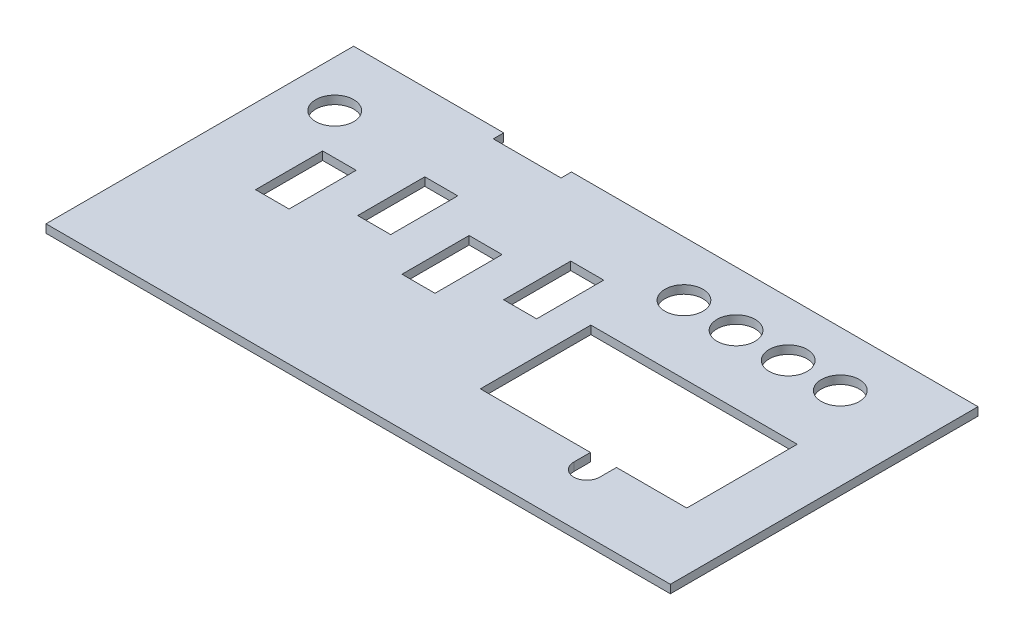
ISO-10303-21;
HEADER;
FILE_DESCRIPTION(('STEP AP214'),'2;1');
FILE_NAME('part.step','',(''),(''),'','','');
FILE_SCHEMA(('AUTOMOTIVE_DESIGN { 1 0 10303 214 1 1 1 1 }'));
ENDSEC;
DATA;
#1=APPLICATION_CONTEXT('core data for automotive mechanical design processes');
#2=APPLICATION_PROTOCOL_DEFINITION('international standard','automotive_design',2000,#1);
#3=PRODUCT_CONTEXT('',#1,'mechanical');
#4=PRODUCT('Part','Part','',(#3));
#5=PRODUCT_RELATED_PRODUCT_CATEGORY('part','',(#4));
#6=PRODUCT_DEFINITION_FORMATION('','',#4);
#7=PRODUCT_DEFINITION_CONTEXT('part definition',#1,'design');
#8=PRODUCT_DEFINITION('design','',#6,#7);
#9=PRODUCT_DEFINITION_SHAPE('','',#8);
#10=(LENGTH_UNIT() NAMED_UNIT(*) SI_UNIT(.MILLI.,.METRE.));
#11=(NAMED_UNIT(*) PLANE_ANGLE_UNIT() SI_UNIT($,.RADIAN.));
#12=(NAMED_UNIT(*) SI_UNIT($,.STERADIAN.) SOLID_ANGLE_UNIT());
#13=UNCERTAINTY_MEASURE_WITH_UNIT(LENGTH_MEASURE(1.E-05),#10,'distance_accuracy_value','');
#14=(GEOMETRIC_REPRESENTATION_CONTEXT(3) GLOBAL_UNCERTAINTY_ASSIGNED_CONTEXT((#13)) GLOBAL_UNIT_ASSIGNED_CONTEXT((#10,
#11,#12)) REPRESENTATION_CONTEXT('',''));
#15=CARTESIAN_POINT('',(0.,0.,0.));
#16=DIRECTION('',(0.,0.,1.));
#17=DIRECTION('',(1.,0.,0.));
#18=AXIS2_PLACEMENT_3D('',#15,#16,#17);
#19=CARTESIAN_POINT('',(48.8,0.,14.76));
#20=DIRECTION('',(0.,0.,1.));
#21=DIRECTION('',(1.,0.,0.));
#22=AXIS2_PLACEMENT_3D('',#19,#20,#21);
#23=PLANE('',#22);
#24=DIRECTION('',(1.,0.,0.));
#25=VECTOR('',#24,1.);
#26=CARTESIAN_POINT('',(48.8,0.,14.76));
#27=LINE('',#26,#25);
#28=CARTESIAN_POINT('',(35.32,0.,14.76));
#29=VERTEX_POINT('',#28);
#30=CARTESIAN_POINT('',(48.8,0.,14.76));
#31=VERTEX_POINT('',#30);
#32=EDGE_CURVE('E449',#29,#31,#27,.T.);
#33=ORIENTED_EDGE('',*,*,#32,.F.);
#34=DIRECTION('',(0.,-1.,0.));
#35=VECTOR('',#34,1.);
#36=CARTESIAN_POINT('',(35.32,1.5875,14.76));
#37=LINE('',#36,#35);
#38=CARTESIAN_POINT('',(35.32,1.5875,14.76));
#39=VERTEX_POINT('',#38);
#40=EDGE_CURVE('E277',#39,#29,#37,.T.);
#41=ORIENTED_EDGE('',*,*,#40,.F.);
#42=DIRECTION('',(1.,0.,0.));
#43=VECTOR('',#42,1.);
#44=CARTESIAN_POINT('',(48.8,1.5875,14.76));
#45=LINE('',#44,#43);
#46=CARTESIAN_POINT('',(48.8,1.5875,14.76));
#47=VERTEX_POINT('',#46);
#48=EDGE_CURVE('E269',#39,#47,#45,.T.);
#49=ORIENTED_EDGE('',*,*,#48,.T.);
#50=DIRECTION('',(0.,1.,0.));
#51=VECTOR('',#50,1.);
#52=CARTESIAN_POINT('',(48.8,0.,14.76));
#53=LINE('',#52,#51);
#54=EDGE_CURVE('E463',#31,#47,#53,.T.);
#55=ORIENTED_EDGE('',*,*,#54,.F.);
#56=EDGE_LOOP('',(#33,#41,#49,#55));
#57=FACE_BOUND('',#56,.T.);
#58=ADVANCED_FACE('F36',(#57),#23,.F.);
#59=CARTESIAN_POINT('',(0.,0.,0.));
#60=DIRECTION('',(0.,-1.,0.));
#61=DIRECTION('',(0.,0.,-1.));
#62=AXIS2_PLACEMENT_3D('',#59,#60,#61);
#63=PLANE('',#62);
#64=DIRECTION('',(0.,0.,1.));
#65=VECTOR('',#64,1.);
#66=CARTESIAN_POINT('',(35.32,0.,17.96));
#67=LINE('',#66,#65);
#68=CARTESIAN_POINT('',(35.32,0.,17.96));
#69=VERTEX_POINT('',#68);
#70=EDGE_CURVE('E251',#29,#69,#67,.T.);
#71=ORIENTED_EDGE('',*,*,#70,.F.);
#72=ORIENTED_EDGE('',*,*,#32,.T.);
#73=DIRECTION('',(0.,0.,-1.));
#74=VECTOR('',#73,1.);
#75=CARTESIAN_POINT('',(48.8,0.,14.76));
#76=LINE('',#75,#74);
#77=CARTESIAN_POINT('',(48.8,0.,-6.43999999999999));
#78=VERTEX_POINT('',#77);
#79=EDGE_CURVE('E439',#31,#78,#76,.T.);
#80=ORIENTED_EDGE('',*,*,#79,.T.);
#81=DIRECTION('',(-1.,0.,0.));
#82=VECTOR('',#81,1.);
#83=CARTESIAN_POINT('',(48.8,0.,-6.43999999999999));
#84=LINE('',#83,#82);
#85=CARTESIAN_POINT('',(9.19999999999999,0.,-6.43999999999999));
#86=VERTEX_POINT('',#85);
#87=EDGE_CURVE('E442',#78,#86,#84,.T.);
#88=ORIENTED_EDGE('',*,*,#87,.T.);
#89=DIRECTION('',(0.,0.,1.));
#90=VECTOR('',#89,1.);
#91=CARTESIAN_POINT('',(9.19999999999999,0.,-6.43999999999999));
#92=LINE('',#91,#90);
#93=CARTESIAN_POINT('',(9.19999999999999,0.,14.76));
#94=VERTEX_POINT('',#93);
#95=EDGE_CURVE('E446',#86,#94,#92,.T.);
#96=ORIENTED_EDGE('',*,*,#95,.T.);
#97=CARTESIAN_POINT('',(30.32,0.,14.76));
#98=VERTEX_POINT('',#97);
#99=EDGE_CURVE('E450',#94,#98,#27,.T.);
#100=ORIENTED_EDGE('',*,*,#99,.T.);
#101=DIRECTION('',(0.,0.,-1.));
#102=VECTOR('',#101,1.);
#103=CARTESIAN_POINT('',(30.32,0.,14.76));
#104=LINE('',#103,#102);
#105=CARTESIAN_POINT('',(30.32,0.,17.96));
#106=VERTEX_POINT('',#105);
#107=EDGE_CURVE('E51',#106,#98,#104,.T.);
#108=ORIENTED_EDGE('',*,*,#107,.F.);
#109=CARTESIAN_POINT('',(32.82,0.,17.96));
#110=DIRECTION('',(0.,-1.,0.));
#111=DIRECTION('',(0.,0.,-1.));
#112=AXIS2_PLACEMENT_3D('',#109,#110,#111);
#113=CIRCLE('',#112,2.5);
#114=EDGE_CURVE('E271',#69,#106,#113,.T.);
#115=ORIENTED_EDGE('',*,*,#114,.F.);
#116=EDGE_LOOP('',(#71,#72,#80,#88,#96,#100,#108,#115));
#117=FACE_BOUND('',#116,.T.);
#118=CARTESIAN_POINT('',(14.,0.,-19.5));
#119=DIRECTION('',(0.,1.,0.));
#120=DIRECTION('',(0.,0.,1.));
#121=AXIS2_PLACEMENT_3D('',#118,#119,#120);
#122=CIRCLE('',#121,3.65000000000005);
#123=CARTESIAN_POINT('',(14.,0.,-15.85));
#124=VERTEX_POINT('',#123);
#125=EDGE_CURVE('E353',#124,#124,#122,.T.);
#126=ORIENTED_EDGE('',*,*,#125,.T.);
#127=EDGE_LOOP('',(#126));
#128=FACE_BOUND('',#127,.T.);
#129=CARTESIAN_POINT('',(34.,0.,-19.5));
#130=DIRECTION('',(0.,1.,0.));
#131=DIRECTION('',(0.,0.,1.));
#132=AXIS2_PLACEMENT_3D('',#129,#130,#131);
#133=CIRCLE('',#132,3.65000000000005);
#134=CARTESIAN_POINT('',(34.,0.,-15.85));
#135=VERTEX_POINT('',#134);
#136=EDGE_CURVE('E360',#135,#135,#133,.T.);
#137=ORIENTED_EDGE('',*,*,#136,.T.);
#138=EDGE_LOOP('',(#137));
#139=FACE_BOUND('',#138,.T.);
#140=CARTESIAN_POINT('',(44.,0.,-19.5));
#141=DIRECTION('',(0.,1.,0.));
#142=DIRECTION('',(0.,0.,1.));
#143=AXIS2_PLACEMENT_3D('',#140,#141,#142);
#144=CIRCLE('',#143,3.65000000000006);
#145=CARTESIAN_POINT('',(44.,0.,-15.8499999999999));
#146=VERTEX_POINT('',#145);
#147=EDGE_CURVE('E366',#146,#146,#144,.T.);
#148=ORIENTED_EDGE('',*,*,#147,.T.);
#149=EDGE_LOOP('',(#148));
#150=FACE_BOUND('',#149,.T.);
#151=CARTESIAN_POINT('',(-51.,0.,-17.5000000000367));
#152=DIRECTION('',(0.,1.,0.));
#153=DIRECTION('',(0.,0.,1.));
#154=AXIS2_PLACEMENT_3D('',#151,#152,#153);
#155=CIRCLE('',#154,3.65000000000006);
#156=CARTESIAN_POINT('',(-51.,0.,-13.8500000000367));
#157=VERTEX_POINT('',#156);
#158=EDGE_CURVE('E372',#157,#157,#155,.T.);
#159=ORIENTED_EDGE('',*,*,#158,.T.);
#160=EDGE_LOOP('',(#159));
#161=FACE_BOUND('',#160,.T.);
#162=DIRECTION('',(-1.,0.,0.));
#163=VECTOR('',#162,1.);
#164=CARTESIAN_POINT('',(2.96550000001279,0.,-15.1431105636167));
#165=LINE('',#164,#163);
#166=CARTESIAN_POINT('',(2.96550000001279,0.,-15.1431105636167));
#167=VERTEX_POINT('',#166);
#168=CARTESIAN_POINT('',(-3.36550000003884,0.,-15.1431105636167));
#169=VERTEX_POINT('',#168);
#170=EDGE_CURVE('E379',#167,#169,#165,.T.);
#171=ORIENTED_EDGE('',*,*,#170,.T.);
#172=DIRECTION('',(2.77146929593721E-12,0.,1.));
#173=VECTOR('',#172,1.);
#174=CARTESIAN_POINT('',(-3.36550000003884,0.,-15.1431105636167));
#175=LINE('',#174,#173);
#176=CARTESIAN_POINT('',(-3.36550000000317,0.,-2.26977374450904));
#177=VERTEX_POINT('',#176);
#178=EDGE_CURVE('E382',#169,#177,#175,.T.);
#179=ORIENTED_EDGE('',*,*,#178,.T.);
#180=DIRECTION('',(1.,0.,0.));
#181=VECTOR('',#180,1.);
#182=CARTESIAN_POINT('',(-3.36550000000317,0.,-2.26977374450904));
#183=LINE('',#182,#181);
#184=CARTESIAN_POINT('',(2.96550000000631,0.,-2.26977374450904));
#185=VERTEX_POINT('',#184);
#186=EDGE_CURVE('E59',#177,#185,#183,.T.);
#187=ORIENTED_EDGE('',*,*,#186,.T.);
#188=DIRECTION('',(5.03303244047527E-13,0.,-1.));
#189=VECTOR('',#188,1.);
#190=CARTESIAN_POINT('',(2.96550000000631,0.,-2.26977374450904));
#191=LINE('',#190,#189);
#192=EDGE_CURVE('E387',#185,#167,#191,.T.);
#193=ORIENTED_EDGE('',*,*,#192,.T.);
#194=EDGE_LOOP('',(#171,#179,#187,#193));
#195=FACE_BOUND('',#194,.T.);
#196=DIRECTION('',(-1.,0.,0.));
#197=VECTOR('',#196,1.);
#198=CARTESIAN_POINT('',(-11.0344999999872,0.,-9.64311056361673));
#199=LINE('',#198,#197);
#200=CARTESIAN_POINT('',(-11.0344999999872,0.,-9.64311056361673));
#201=VERTEX_POINT('',#200);
#202=CARTESIAN_POINT('',(-17.3655000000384,0.,-9.64311056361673));
#203=VERTEX_POINT('',#202);
#204=EDGE_CURVE('E409',#201,#203,#199,.T.);
#205=ORIENTED_EDGE('',*,*,#204,.T.);
#206=DIRECTION('',(3.39578092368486E-12,0.,1.));
#207=VECTOR('',#206,1.);
#208=CARTESIAN_POINT('',(-17.3655000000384,0.,-9.64311056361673));
#209=LINE('',#208,#207);
#210=CARTESIAN_POINT('',(-17.3654999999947,0.,3.23022625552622));
#211=VERTEX_POINT('',#210);
#212=EDGE_CURVE('E412',#203,#211,#209,.T.);
#213=ORIENTED_EDGE('',*,*,#212,.T.);
#214=DIRECTION('',(1.,0.,-5.01524421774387E-12));
#215=VECTOR('',#214,1.);
#216=CARTESIAN_POINT('',(-17.3654999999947,0.,3.23022625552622));
#217=LINE('',#216,#215);
#218=CARTESIAN_POINT('',(-11.0344999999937,0.,3.23022625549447));
#219=VERTEX_POINT('',#218);
#220=EDGE_CURVE('E416',#211,#219,#217,.T.);
#221=ORIENTED_EDGE('',*,*,#220,.T.);
#222=DIRECTION('',(5.03437997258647E-13,0.,-1.));
#223=VECTOR('',#222,1.);
#224=CARTESIAN_POINT('',(-11.0344999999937,0.,3.23022625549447));
#225=LINE('',#224,#223);
#226=EDGE_CURVE('E419',#219,#201,#225,.T.);
#227=ORIENTED_EDGE('',*,*,#226,.T.);
#228=EDGE_LOOP('',(#205,#213,#221,#227));
#229=FACE_BOUND('',#228,.T.);
#230=DIRECTION('',(2.7710650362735E-12,0.,1.));
#231=VECTOR('',#230,1.);
#232=CARTESIAN_POINT('',(-31.3655000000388,0.,-15.1431105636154));
#233=LINE('',#232,#231);
#234=CARTESIAN_POINT('',(-31.3655000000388,0.,-15.1431105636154));
#235=VERTEX_POINT('',#234);
#236=CARTESIAN_POINT('',(-31.3655000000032,0.,-2.26977374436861));
#237=VERTEX_POINT('',#236);
#238=EDGE_CURVE('E283',#235,#237,#233,.T.);
#239=ORIENTED_EDGE('',*,*,#238,.T.);
#240=DIRECTION('',(1.,0.,0.));
#241=VECTOR('',#240,1.);
#242=CARTESIAN_POINT('',(-31.3655000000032,0.,-2.26977374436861));
#243=LINE('',#242,#241);
#244=CARTESIAN_POINT('',(-25.0344999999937,0.,-2.26977374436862));
#245=VERTEX_POINT('',#244);
#246=EDGE_CURVE('E286',#237,#245,#243,.T.);
#247=ORIENTED_EDGE('',*,*,#246,.T.);
#248=DIRECTION('',(5.03168490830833E-13,0.,-1.));
#249=VECTOR('',#248,1.);
#250=CARTESIAN_POINT('',(-25.0344999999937,0.,-2.26977374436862));
#251=LINE('',#250,#249);
#252=CARTESIAN_POINT('',(-25.0344999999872,0.,-15.1431105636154));
#253=VERTEX_POINT('',#252);
#254=EDGE_CURVE('E290',#245,#253,#251,.T.);
#255=ORIENTED_EDGE('',*,*,#254,.T.);
#256=DIRECTION('',(-1.,0.,0.));
#257=VECTOR('',#256,1.);
#258=CARTESIAN_POINT('',(-25.0344999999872,0.,-15.1431105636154));
#259=LINE('',#258,#257);
#260=EDGE_CURVE('E293',#253,#235,#259,.T.);
#261=ORIENTED_EDGE('',*,*,#260,.T.);
#262=EDGE_LOOP('',(#239,#247,#255,#261));
#263=FACE_BOUND('',#262,.T.);
#264=DIRECTION('',(0.,0.,1.));
#265=VECTOR('',#264,1.);
#266=CARTESIAN_POINT('',(-45.46,0.,-9.64311056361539));
#267=LINE('',#266,#265);
#268=CARTESIAN_POINT('',(-45.46,0.,-9.64311056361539));
#269=VERTEX_POINT('',#268);
#270=CARTESIAN_POINT('',(-45.46,0.,3.23022625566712));
#271=VERTEX_POINT('',#270);
#272=EDGE_CURVE('E317',#269,#271,#267,.T.);
#273=ORIENTED_EDGE('',*,*,#272,.T.);
#274=DIRECTION('',(1.,0.,-5.01532301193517E-12));
#275=VECTOR('',#274,1.);
#276=CARTESIAN_POINT('',(-45.46,0.,3.23022625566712));
#277=LINE('',#276,#275);
#278=CARTESIAN_POINT('',(-39.0344999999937,0.,3.2302262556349));
#279=VERTEX_POINT('',#278);
#280=EDGE_CURVE('E320',#271,#279,#277,.T.);
#281=ORIENTED_EDGE('',*,*,#280,.T.);
#282=DIRECTION('',(5.02898984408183E-13,0.,-1.));
#283=VECTOR('',#282,1.);
#284=CARTESIAN_POINT('',(-39.0344999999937,0.,3.2302262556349));
#285=LINE('',#284,#283);
#286=CARTESIAN_POINT('',(-39.0344999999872,0.,-9.64311056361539));
#287=VERTEX_POINT('',#286);
#288=EDGE_CURVE('E324',#279,#287,#285,.T.);
#289=ORIENTED_EDGE('',*,*,#288,.T.);
#290=DIRECTION('',(-1.,0.,0.));
#291=VECTOR('',#290,1.);
#292=CARTESIAN_POINT('',(-39.0344999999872,0.,-9.64311056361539));
#293=LINE('',#292,#291);
#294=EDGE_CURVE('E327',#287,#269,#293,.T.);
#295=ORIENTED_EDGE('',*,*,#294,.T.);
#296=EDGE_LOOP('',(#273,#281,#289,#295));
#297=FACE_BOUND('',#296,.T.);
#298=CARTESIAN_POINT('',(24.,0.,-19.5));
#299=DIRECTION('',(0.,1.,0.));
#300=DIRECTION('',(0.,0.,1.));
#301=AXIS2_PLACEMENT_3D('',#298,#299,#300);
#302=CIRCLE('',#301,3.65000000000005);
#303=CARTESIAN_POINT('',(24.,0.,-15.8499999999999));
#304=VERTEX_POINT('',#303);
#305=EDGE_CURVE('E334',#304,#304,#302,.T.);
#306=ORIENTED_EDGE('',*,*,#305,.T.);
#307=EDGE_LOOP('',(#306));
#308=FACE_BOUND('',#307,.T.);
#309=DIRECTION('',(0.,0.,1.));
#310=VECTOR('',#309,1.);
#311=CARTESIAN_POINT('',(-31.1,0.,-30.02));
#312=LINE('',#311,#310);
#313=CARTESIAN_POINT('',(-31.1,0.,-30.02));
#314=VERTEX_POINT('',#313);
#315=CARTESIAN_POINT('',(-31.1,0.,-28.02));
#316=VERTEX_POINT('',#315);
#317=EDGE_CURVE('E493',#314,#316,#312,.T.);
#318=ORIENTED_EDGE('',*,*,#317,.T.);
#319=DIRECTION('',(1.,0.,0.));
#320=VECTOR('',#319,1.);
#321=CARTESIAN_POINT('',(-31.1,0.,-28.02));
#322=LINE('',#321,#320);
#323=CARTESIAN_POINT('',(-18.1,0.,-28.02));
#324=VERTEX_POINT('',#323);
#325=EDGE_CURVE('E466',#316,#324,#322,.T.);
#326=ORIENTED_EDGE('',*,*,#325,.T.);
#327=DIRECTION('',(0.,0.,-1.));
#328=VECTOR('',#327,1.);
#329=CARTESIAN_POINT('',(-18.1,0.,-28.02));
#330=LINE('',#329,#328);
#331=CARTESIAN_POINT('',(-18.1,0.,-30.02));
#332=VERTEX_POINT('',#331);
#333=EDGE_CURVE('E475',#324,#332,#330,.T.);
#334=ORIENTED_EDGE('',*,*,#333,.T.);
#335=DIRECTION('',(1.,0.,0.));
#336=VECTOR('',#335,1.);
#337=CARTESIAN_POINT('',(-18.1,0.,-30.02));
#338=LINE('',#337,#336);
#339=CARTESIAN_POINT('',(59.895,0.,-30.02));
#340=VERTEX_POINT('',#339);
#341=EDGE_CURVE('E478',#332,#340,#338,.T.);
#342=ORIENTED_EDGE('',*,*,#341,.T.);
#343=DIRECTION('',(0.,0.,1.));
#344=VECTOR('',#343,1.);
#345=CARTESIAN_POINT('',(59.895,0.,-30.02));
#346=LINE('',#345,#344);
#347=CARTESIAN_POINT('',(59.895,0.,29.));
#348=VERTEX_POINT('',#347);
#349=EDGE_CURVE('E481',#340,#348,#346,.T.);
#350=ORIENTED_EDGE('',*,*,#349,.T.);
#351=DIRECTION('',(-1.,0.,0.));
#352=VECTOR('',#351,1.);
#353=CARTESIAN_POINT('',(59.895,0.,29.));
#354=LINE('',#353,#352);
#355=CARTESIAN_POINT('',(-59.895,0.,29.));
#356=VERTEX_POINT('',#355);
#357=EDGE_CURVE('E484',#348,#356,#354,.T.);
#358=ORIENTED_EDGE('',*,*,#357,.T.);
#359=DIRECTION('',(0.,0.,-1.));
#360=VECTOR('',#359,1.);
#361=CARTESIAN_POINT('',(-59.895,0.,29.));
#362=LINE('',#361,#360);
#363=CARTESIAN_POINT('',(-59.895,0.,-30.02));
#364=VERTEX_POINT('',#363);
#365=EDGE_CURVE('E487',#356,#364,#362,.T.);
#366=ORIENTED_EDGE('',*,*,#365,.T.);
#367=DIRECTION('',(1.,0.,0.));
#368=VECTOR('',#367,1.);
#369=CARTESIAN_POINT('',(-59.895,0.,-30.02));
#370=LINE('',#369,#368);
#371=EDGE_CURVE('E490',#364,#314,#370,.T.);
#372=ORIENTED_EDGE('',*,*,#371,.T.);
#373=EDGE_LOOP('',(#318,#326,#334,#342,#350,#358,#366,#372));
#374=FACE_BOUND('',#373,.T.);
#375=ADVANCED_FACE('F38',(#117,#128,#139,#150,#161,#195,#229,#263,#297,#308,#374),#63,.T.);
#376=CARTESIAN_POINT('',(-31.1,10.,-28.02));
#377=DIRECTION('',(0.,0.,-1.));
#378=DIRECTION('',(-1.,0.,0.));
#379=AXIS2_PLACEMENT_3D('',#376,#377,#378);
#380=PLANE('',#379);
#381=DIRECTION('',(1.,0.,0.));
#382=VECTOR('',#381,1.);
#383=CARTESIAN_POINT('',(0.,1.5875,-28.02));
#384=LINE('',#383,#382);
#385=CARTESIAN_POINT('',(-31.1,1.5875,-28.02));
#386=VERTEX_POINT('',#385);
#387=CARTESIAN_POINT('',(-18.1,1.5875,-28.02));
#388=VERTEX_POINT('',#387);
#389=EDGE_CURVE('E12',#386,#388,#384,.T.);
#390=ORIENTED_EDGE('',*,*,#389,.T.);
#391=DIRECTION('',(0.,-1.,0.));
#392=VECTOR('',#391,1.);
#393=CARTESIAN_POINT('',(-18.1,10.,-28.02));
#394=LINE('',#393,#392);
#395=EDGE_CURVE('E496',#388,#324,#394,.T.);
#396=ORIENTED_EDGE('',*,*,#395,.T.);
#397=ORIENTED_EDGE('',*,*,#325,.F.);
#398=DIRECTION('',(0.,-1.,0.));
#399=VECTOR('',#398,1.);
#400=CARTESIAN_POINT('',(-31.1,10.,-28.02));
#401=LINE('',#400,#399);
#402=EDGE_CURVE('E497',#386,#316,#401,.T.);
#403=ORIENTED_EDGE('',*,*,#402,.F.);
#404=EDGE_LOOP('',(#390,#396,#397,#403));
#405=FACE_BOUND('',#404,.T.);
#406=ADVANCED_FACE('F535',(#405),#380,.T.);
#407=CARTESIAN_POINT('',(-31.1,10.,-30.02));
#408=DIRECTION('',(1.,0.,0.));
#409=DIRECTION('',(0.,0.,-1.));
#410=AXIS2_PLACEMENT_3D('',#407,#408,#409);
#411=PLANE('',#410);
#412=DIRECTION('',(0.,0.,1.));
#413=VECTOR('',#412,1.);
#414=CARTESIAN_POINT('',(-31.1,1.5875,0.));
#415=LINE('',#414,#413);
#416=CARTESIAN_POINT('',(-31.1,1.5875,-30.02));
#417=VERTEX_POINT('',#416);
#418=EDGE_CURVE('E44',#417,#386,#415,.T.);
#419=ORIENTED_EDGE('',*,*,#418,.T.);
#420=ORIENTED_EDGE('',*,*,#402,.T.);
#421=ORIENTED_EDGE('',*,*,#317,.F.);
#422=DIRECTION('',(0.,-1.,0.));
#423=VECTOR('',#422,1.);
#424=CARTESIAN_POINT('',(-31.1,10.,-30.02));
#425=LINE('',#424,#423);
#426=EDGE_CURVE('E500',#417,#314,#425,.T.);
#427=ORIENTED_EDGE('',*,*,#426,.F.);
#428=EDGE_LOOP('',(#419,#420,#421,#427));
#429=FACE_BOUND('',#428,.T.);
#430=ADVANCED_FACE('F528',(#429),#411,.T.);
#431=CARTESIAN_POINT('',(-59.895,10.,-30.02));
#432=DIRECTION('',(0.,0.,-1.));
#433=DIRECTION('',(-1.,0.,0.));
#434=AXIS2_PLACEMENT_3D('',#431,#432,#433);
#435=PLANE('',#434);
#436=DIRECTION('',(1.,0.,0.));
#437=VECTOR('',#436,1.);
#438=CARTESIAN_POINT('',(0.,1.5875,-30.02));
#439=LINE('',#438,#437);
#440=CARTESIAN_POINT('',(-59.895,1.5875,-30.02));
#441=VERTEX_POINT('',#440);
#442=EDGE_CURVE('E523',#441,#417,#439,.T.);
#443=ORIENTED_EDGE('',*,*,#442,.T.);
#444=ORIENTED_EDGE('',*,*,#426,.T.);
#445=ORIENTED_EDGE('',*,*,#371,.F.);
#446=DIRECTION('',(0.,-1.,0.));
#447=VECTOR('',#446,1.);
#448=CARTESIAN_POINT('',(-59.895,10.,-30.02));
#449=LINE('',#448,#447);
#450=EDGE_CURVE('E502',#441,#364,#449,.T.);
#451=ORIENTED_EDGE('',*,*,#450,.F.);
#452=EDGE_LOOP('',(#443,#444,#445,#451));
#453=FACE_BOUND('',#452,.T.);
#454=ADVANCED_FACE('F552',(#453),#435,.T.);
#455=CARTESIAN_POINT('',(-59.895,10.,29.));
#456=DIRECTION('',(-1.,0.,0.));
#457=DIRECTION('',(0.,0.,1.));
#458=AXIS2_PLACEMENT_3D('',#455,#456,#457);
#459=PLANE('',#458);
#460=DIRECTION('',(0.,0.,-1.));
#461=VECTOR('',#460,1.);
#462=CARTESIAN_POINT('',(-59.895,1.5875,0.));
#463=LINE('',#462,#461);
#464=CARTESIAN_POINT('',(-59.895,1.5875,29.));
#465=VERTEX_POINT('',#464);
#466=EDGE_CURVE('E521',#465,#441,#463,.T.);
#467=ORIENTED_EDGE('',*,*,#466,.T.);
#468=ORIENTED_EDGE('',*,*,#450,.T.);
#469=ORIENTED_EDGE('',*,*,#365,.F.);
#470=DIRECTION('',(0.,-1.,0.));
#471=VECTOR('',#470,1.);
#472=CARTESIAN_POINT('',(-59.895,10.,29.));
#473=LINE('',#472,#471);
#474=EDGE_CURVE('E504',#465,#356,#473,.T.);
#475=ORIENTED_EDGE('',*,*,#474,.F.);
#476=EDGE_LOOP('',(#467,#468,#469,#475));
#477=FACE_BOUND('',#476,.T.);
#478=ADVANCED_FACE('F557',(#477),#459,.T.);
#479=CARTESIAN_POINT('',(59.895,10.,29.));
#480=DIRECTION('',(0.,0.,1.));
#481=DIRECTION('',(1.,0.,0.));
#482=AXIS2_PLACEMENT_3D('',#479,#480,#481);
#483=PLANE('',#482);
#484=DIRECTION('',(-1.,0.,0.));
#485=VECTOR('',#484,1.);
#486=CARTESIAN_POINT('',(0.,1.5875,29.));
#487=LINE('',#486,#485);
#488=CARTESIAN_POINT('',(59.895,1.5875,29.));
#489=VERTEX_POINT('',#488);
#490=EDGE_CURVE('E519',#489,#465,#487,.T.);
#491=ORIENTED_EDGE('',*,*,#490,.T.);
#492=ORIENTED_EDGE('',*,*,#474,.T.);
#493=ORIENTED_EDGE('',*,*,#357,.F.);
#494=DIRECTION('',(0.,-1.,0.));
#495=VECTOR('',#494,1.);
#496=CARTESIAN_POINT('',(59.895,10.,29.));
#497=LINE('',#496,#495);
#498=EDGE_CURVE('E506',#489,#348,#497,.T.);
#499=ORIENTED_EDGE('',*,*,#498,.F.);
#500=EDGE_LOOP('',(#491,#492,#493,#499));
#501=FACE_BOUND('',#500,.T.);
#502=ADVANCED_FACE('F560',(#501),#483,.T.);
#503=CARTESIAN_POINT('',(59.895,10.,-30.02));
#504=DIRECTION('',(1.,0.,0.));
#505=DIRECTION('',(0.,0.,-1.));
#506=AXIS2_PLACEMENT_3D('',#503,#504,#505);
#507=PLANE('',#506);
#508=DIRECTION('',(0.,0.,1.));
#509=VECTOR('',#508,1.);
#510=CARTESIAN_POINT('',(59.895,1.5875,0.));
#511=LINE('',#510,#509);
#512=CARTESIAN_POINT('',(59.895,1.5875,-30.02));
#513=VERTEX_POINT('',#512);
#514=EDGE_CURVE('E517',#513,#489,#511,.T.);
#515=ORIENTED_EDGE('',*,*,#514,.T.);
#516=ORIENTED_EDGE('',*,*,#498,.T.);
#517=ORIENTED_EDGE('',*,*,#349,.F.);
#518=DIRECTION('',(0.,-1.,0.));
#519=VECTOR('',#518,1.);
#520=CARTESIAN_POINT('',(59.895,10.,-30.02));
#521=LINE('',#520,#519);
#522=EDGE_CURVE('E508',#513,#340,#521,.T.);
#523=ORIENTED_EDGE('',*,*,#522,.F.);
#524=EDGE_LOOP('',(#515,#516,#517,#523));
#525=FACE_BOUND('',#524,.T.);
#526=ADVANCED_FACE('F563',(#525),#507,.T.);
#527=CARTESIAN_POINT('',(-18.1,10.,-30.02));
#528=DIRECTION('',(0.,0.,-1.));
#529=DIRECTION('',(-1.,0.,0.));
#530=AXIS2_PLACEMENT_3D('',#527,#528,#529);
#531=PLANE('',#530);
#532=DIRECTION('',(1.,0.,0.));
#533=VECTOR('',#532,1.);
#534=CARTESIAN_POINT('',(0.,1.5875,-30.02));
#535=LINE('',#534,#533);
#536=CARTESIAN_POINT('',(-18.1,1.5875,-30.02));
#537=VERTEX_POINT('',#536);
#538=EDGE_CURVE('E515',#537,#513,#535,.T.);
#539=ORIENTED_EDGE('',*,*,#538,.T.);
#540=ORIENTED_EDGE('',*,*,#522,.T.);
#541=ORIENTED_EDGE('',*,*,#341,.F.);
#542=DIRECTION('',(0.,-1.,0.));
#543=VECTOR('',#542,1.);
#544=CARTESIAN_POINT('',(-18.1,10.,-30.02));
#545=LINE('',#544,#543);
#546=EDGE_CURVE('E510',#537,#332,#545,.T.);
#547=ORIENTED_EDGE('',*,*,#546,.F.);
#548=EDGE_LOOP('',(#539,#540,#541,#547));
#549=FACE_BOUND('',#548,.T.);
#550=ADVANCED_FACE('F544',(#549),#531,.T.);
#551=CARTESIAN_POINT('',(-18.1,10.,-28.02));
#552=DIRECTION('',(-1.,0.,0.));
#553=DIRECTION('',(0.,0.,1.));
#554=AXIS2_PLACEMENT_3D('',#551,#552,#553);
#555=PLANE('',#554);
#556=DIRECTION('',(0.,0.,-1.));
#557=VECTOR('',#556,1.);
#558=CARTESIAN_POINT('',(-18.1,1.5875,0.));
#559=LINE('',#558,#557);
#560=EDGE_CURVE('E499',#388,#537,#559,.T.);
#561=ORIENTED_EDGE('',*,*,#560,.T.);
#562=ORIENTED_EDGE('',*,*,#546,.T.);
#563=ORIENTED_EDGE('',*,*,#333,.F.);
#564=ORIENTED_EDGE('',*,*,#395,.F.);
#565=EDGE_LOOP('',(#561,#562,#563,#564));
#566=FACE_BOUND('',#565,.T.);
#567=ADVANCED_FACE('F541',(#566),#555,.T.);
#568=CARTESIAN_POINT('',(0.,1.5875,0.));
#569=DIRECTION('',(0.,-1.,0.));
#570=DIRECTION('',(0.,0.,-1.));
#571=AXIS2_PLACEMENT_3D('',#568,#569,#570);
#572=PLANE('',#571);
#573=ORIENTED_EDGE('',*,*,#48,.F.);
#574=DIRECTION('',(0.,0.,1.));
#575=VECTOR('',#574,1.);
#576=CARTESIAN_POINT('',(35.32,1.5875,17.96));
#577=LINE('',#576,#575);
#578=CARTESIAN_POINT('',(35.32,1.5875,17.96));
#579=VERTEX_POINT('',#578);
#580=EDGE_CURVE('E248',#39,#579,#577,.T.);
#581=ORIENTED_EDGE('',*,*,#580,.T.);
#582=CARTESIAN_POINT('',(32.82,1.5875,17.96));
#583=DIRECTION('',(0.,-1.,0.));
#584=DIRECTION('',(0.,0.,-1.));
#585=AXIS2_PLACEMENT_3D('',#582,#583,#584);
#586=CIRCLE('',#585,2.5);
#587=CARTESIAN_POINT('',(30.32,1.5875,17.96));
#588=VERTEX_POINT('',#587);
#589=EDGE_CURVE('E259',#579,#588,#586,.T.);
#590=ORIENTED_EDGE('',*,*,#589,.T.);
#591=DIRECTION('',(0.,0.,-1.));
#592=VECTOR('',#591,1.);
#593=CARTESIAN_POINT('',(30.32,1.5875,14.76));
#594=LINE('',#593,#592);
#595=CARTESIAN_POINT('',(30.32,1.5875,14.76));
#596=VERTEX_POINT('',#595);
#597=EDGE_CURVE('E256',#588,#596,#594,.T.);
#598=ORIENTED_EDGE('',*,*,#597,.T.);
#599=CARTESIAN_POINT('',(9.19999999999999,1.5875,14.76));
#600=VERTEX_POINT('',#599);
#601=EDGE_CURVE('E443',#600,#596,#45,.T.);
#602=ORIENTED_EDGE('',*,*,#601,.F.);
#603=DIRECTION('',(0.,0.,1.));
#604=VECTOR('',#603,1.);
#605=CARTESIAN_POINT('',(9.19999999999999,1.5875,-6.43999999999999));
#606=LINE('',#605,#604);
#607=CARTESIAN_POINT('',(9.19999999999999,1.5875,-6.43999999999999));
#608=VERTEX_POINT('',#607);
#609=EDGE_CURVE('E458',#608,#600,#606,.T.);
#610=ORIENTED_EDGE('',*,*,#609,.F.);
#611=DIRECTION('',(-1.,0.,0.));
#612=VECTOR('',#611,1.);
#613=CARTESIAN_POINT('',(48.8,1.5875,-6.43999999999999));
#614=LINE('',#613,#612);
#615=CARTESIAN_POINT('',(48.8,1.5875,-6.43999999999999));
#616=VERTEX_POINT('',#615);
#617=EDGE_CURVE('E455',#616,#608,#614,.T.);
#618=ORIENTED_EDGE('',*,*,#617,.F.);
#619=DIRECTION('',(0.,0.,-1.));
#620=VECTOR('',#619,1.);
#621=CARTESIAN_POINT('',(48.8,1.5875,14.76));
#622=LINE('',#621,#620);
#623=EDGE_CURVE('E356',#47,#616,#622,.T.);
#624=ORIENTED_EDGE('',*,*,#623,.F.);
#625=EDGE_LOOP('',(#573,#581,#590,#598,#602,#610,#618,#624));
#626=FACE_BOUND('',#625,.T.);
#627=CARTESIAN_POINT('',(14.,1.5875,-19.5));
#628=DIRECTION('',(0.,1.,0.));
#629=DIRECTION('',(0.,0.,1.));
#630=AXIS2_PLACEMENT_3D('',#627,#628,#629);
#631=CIRCLE('',#630,3.65000000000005);
#632=CARTESIAN_POINT('',(14.,1.5875,-15.85));
#633=VERTEX_POINT('',#632);
#634=EDGE_CURVE('E357',#633,#633,#631,.T.);
#635=ORIENTED_EDGE('',*,*,#634,.F.);
#636=EDGE_LOOP('',(#635));
#637=FACE_BOUND('',#636,.T.);
#638=CARTESIAN_POINT('',(34.,1.5875,-19.5));
#639=DIRECTION('',(0.,1.,0.));
#640=DIRECTION('',(0.,0.,1.));
#641=AXIS2_PLACEMENT_3D('',#638,#639,#640);
#642=CIRCLE('',#641,3.65000000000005);
#643=CARTESIAN_POINT('',(34.,1.5875,-15.85));
#644=VERTEX_POINT('',#643);
#645=EDGE_CURVE('E363',#644,#644,#642,.T.);
#646=ORIENTED_EDGE('',*,*,#645,.F.);
#647=EDGE_LOOP('',(#646));
#648=FACE_BOUND('',#647,.T.);
#649=CARTESIAN_POINT('',(44.,1.5875,-19.5));
#650=DIRECTION('',(0.,1.,0.));
#651=DIRECTION('',(0.,0.,1.));
#652=AXIS2_PLACEMENT_3D('',#649,#650,#651);
#653=CIRCLE('',#652,3.65000000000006);
#654=CARTESIAN_POINT('',(44.,1.5875,-15.8499999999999));
#655=VERTEX_POINT('',#654);
#656=EDGE_CURVE('E369',#655,#655,#653,.T.);
#657=ORIENTED_EDGE('',*,*,#656,.F.);
#658=EDGE_LOOP('',(#657));
#659=FACE_BOUND('',#658,.T.);
#660=CARTESIAN_POINT('',(-51.,1.5875,-17.5000000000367));
#661=DIRECTION('',(0.,1.,0.));
#662=DIRECTION('',(0.,0.,1.));
#663=AXIS2_PLACEMENT_3D('',#660,#661,#662);
#664=CIRCLE('',#663,3.65000000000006);
#665=CARTESIAN_POINT('',(-51.,1.5875,-13.8500000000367));
#666=VERTEX_POINT('',#665);
#667=EDGE_CURVE('E375',#666,#666,#664,.T.);
#668=ORIENTED_EDGE('',*,*,#667,.F.);
#669=EDGE_LOOP('',(#668));
#670=FACE_BOUND('',#669,.T.);
#671=DIRECTION('',(2.77146929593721E-12,0.,1.));
#672=VECTOR('',#671,1.);
#673=CARTESIAN_POINT('',(-3.36550000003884,1.5875,-15.1431105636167));
#674=LINE('',#673,#672);
#675=CARTESIAN_POINT('',(-3.36550000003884,1.5875,-15.1431105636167));
#676=VERTEX_POINT('',#675);
#677=CARTESIAN_POINT('',(-3.36550000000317,1.5875,-2.26977374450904));
#678=VERTEX_POINT('',#677);
#679=EDGE_CURVE('E393',#676,#678,#674,.T.);
#680=ORIENTED_EDGE('',*,*,#679,.F.);
#681=DIRECTION('',(-1.,0.,0.));
#682=VECTOR('',#681,1.);
#683=CARTESIAN_POINT('',(2.96550000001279,1.5875,-15.1431105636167));
#684=LINE('',#683,#682);
#685=CARTESIAN_POINT('',(2.96550000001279,1.5875,-15.1431105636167));
#686=VERTEX_POINT('',#685);
#687=EDGE_CURVE('E391',#686,#676,#684,.T.);
#688=ORIENTED_EDGE('',*,*,#687,.F.);
#689=DIRECTION('',(5.03303244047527E-13,0.,-1.));
#690=VECTOR('',#689,1.);
#691=CARTESIAN_POINT('',(2.96550000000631,1.5875,-2.26977374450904));
#692=LINE('',#691,#690);
#693=CARTESIAN_POINT('',(2.96550000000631,1.5875,-2.26977374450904));
#694=VERTEX_POINT('',#693);
#695=EDGE_CURVE('E383',#694,#686,#692,.T.);
#696=ORIENTED_EDGE('',*,*,#695,.F.);
#697=DIRECTION('',(1.,0.,0.));
#698=VECTOR('',#697,1.);
#699=CARTESIAN_POINT('',(-3.36550000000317,1.5875,-2.26977374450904));
#700=LINE('',#699,#698);
#701=EDGE_CURVE('E397',#678,#694,#700,.T.);
#702=ORIENTED_EDGE('',*,*,#701,.F.);
#703=EDGE_LOOP('',(#680,#688,#696,#702));
#704=FACE_BOUND('',#703,.T.);
#705=DIRECTION('',(3.39578092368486E-12,0.,1.));
#706=VECTOR('',#705,1.);
#707=CARTESIAN_POINT('',(-17.3655000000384,1.5875,-9.64311056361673));
#708=LINE('',#707,#706);
#709=CARTESIAN_POINT('',(-17.3655000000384,1.5875,-9.64311056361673));
#710=VERTEX_POINT('',#709);
#711=CARTESIAN_POINT('',(-17.3654999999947,1.5875,3.23022625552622));
#712=VERTEX_POINT('',#711);
#713=EDGE_CURVE('E424',#710,#712,#708,.T.);
#714=ORIENTED_EDGE('',*,*,#713,.F.);
#715=DIRECTION('',(-1.,0.,0.));
#716=VECTOR('',#715,1.);
#717=CARTESIAN_POINT('',(-11.0344999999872,1.5875,-9.64311056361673));
#718=LINE('',#717,#716);
#719=CARTESIAN_POINT('',(-11.0344999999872,1.5875,-9.64311056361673));
#720=VERTEX_POINT('',#719);
#721=EDGE_CURVE('E310',#720,#710,#718,.T.);
#722=ORIENTED_EDGE('',*,*,#721,.F.);
#723=DIRECTION('',(5.03437997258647E-13,0.,-1.));
#724=VECTOR('',#723,1.);
#725=CARTESIAN_POINT('',(-11.0344999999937,1.5875,3.23022625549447));
#726=LINE('',#725,#724);
#727=CARTESIAN_POINT('',(-11.0344999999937,1.5875,3.23022625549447));
#728=VERTEX_POINT('',#727);
#729=EDGE_CURVE('E413',#728,#720,#726,.T.);
#730=ORIENTED_EDGE('',*,*,#729,.F.);
#731=DIRECTION('',(1.,0.,-5.01524421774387E-12));
#732=VECTOR('',#731,1.);
#733=CARTESIAN_POINT('',(-17.3654999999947,1.5875,3.23022625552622));
#734=LINE('',#733,#732);
#735=EDGE_CURVE('E427',#712,#728,#734,.T.);
#736=ORIENTED_EDGE('',*,*,#735,.F.);
#737=EDGE_LOOP('',(#714,#722,#730,#736));
#738=FACE_BOUND('',#737,.T.);
#739=DIRECTION('',(1.,0.,0.));
#740=VECTOR('',#739,1.);
#741=CARTESIAN_POINT('',(-31.3655000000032,1.5875,-2.26977374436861));
#742=LINE('',#741,#740);
#743=CARTESIAN_POINT('',(-31.3655000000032,1.5875,-2.26977374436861));
#744=VERTEX_POINT('',#743);
#745=CARTESIAN_POINT('',(-25.0344999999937,1.5875,-2.26977374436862));
#746=VERTEX_POINT('',#745);
#747=EDGE_CURVE('E299',#744,#746,#742,.T.);
#748=ORIENTED_EDGE('',*,*,#747,.F.);
#749=DIRECTION('',(2.7710650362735E-12,0.,1.));
#750=VECTOR('',#749,1.);
#751=CARTESIAN_POINT('',(-31.3655000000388,1.5875,-15.1431105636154));
#752=LINE('',#751,#750);
#753=CARTESIAN_POINT('',(-31.3655000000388,1.5875,-15.1431105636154));
#754=VERTEX_POINT('',#753);
#755=EDGE_CURVE('E297',#754,#744,#752,.T.);
#756=ORIENTED_EDGE('',*,*,#755,.F.);
#757=DIRECTION('',(-1.,0.,0.));
#758=VECTOR('',#757,1.);
#759=CARTESIAN_POINT('',(-25.0344999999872,1.5875,-15.1431105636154));
#760=LINE('',#759,#758);
#761=CARTESIAN_POINT('',(-25.0344999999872,1.5875,-15.1431105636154));
#762=VERTEX_POINT('',#761);
#763=EDGE_CURVE('E287',#762,#754,#760,.T.);
#764=ORIENTED_EDGE('',*,*,#763,.F.);
#765=DIRECTION('',(5.03168490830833E-13,0.,-1.));
#766=VECTOR('',#765,1.);
#767=CARTESIAN_POINT('',(-25.0344999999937,1.5875,-2.26977374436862));
#768=LINE('',#767,#766);
#769=EDGE_CURVE('E303',#746,#762,#768,.T.);
#770=ORIENTED_EDGE('',*,*,#769,.F.);
#771=EDGE_LOOP('',(#748,#756,#764,#770));
#772=FACE_BOUND('',#771,.T.);
#773=DIRECTION('',(1.,0.,-5.01532301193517E-12));
#774=VECTOR('',#773,1.);
#775=CARTESIAN_POINT('',(-45.46,1.5875,3.23022625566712));
#776=LINE('',#775,#774);
#777=CARTESIAN_POINT('',(-45.46,1.5875,3.23022625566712));
#778=VERTEX_POINT('',#777);
#779=CARTESIAN_POINT('',(-39.0344999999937,1.5875,3.2302262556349));
#780=VERTEX_POINT('',#779);
#781=EDGE_CURVE('E333',#778,#780,#776,.T.);
#782=ORIENTED_EDGE('',*,*,#781,.F.);
#783=DIRECTION('',(0.,0.,1.));
#784=VECTOR('',#783,1.);
#785=CARTESIAN_POINT('',(-45.46,1.5875,-9.64311056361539));
#786=LINE('',#785,#784);
#787=CARTESIAN_POINT('',(-45.46,1.5875,-9.64311056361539));
#788=VERTEX_POINT('',#787);
#789=EDGE_CURVE('E331',#788,#778,#786,.T.);
#790=ORIENTED_EDGE('',*,*,#789,.F.);
#791=DIRECTION('',(-1.,0.,0.));
#792=VECTOR('',#791,1.);
#793=CARTESIAN_POINT('',(-39.0344999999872,1.5875,-9.64311056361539));
#794=LINE('',#793,#792);
#795=CARTESIAN_POINT('',(-39.0344999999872,1.5875,-9.64311056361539));
#796=VERTEX_POINT('',#795);
#797=EDGE_CURVE('E321',#796,#788,#794,.T.);
#798=ORIENTED_EDGE('',*,*,#797,.F.);
#799=DIRECTION('',(5.02898984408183E-13,0.,-1.));
#800=VECTOR('',#799,1.);
#801=CARTESIAN_POINT('',(-39.0344999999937,1.5875,3.2302262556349));
#802=LINE('',#801,#800);
#803=EDGE_CURVE('E337',#780,#796,#802,.T.);
#804=ORIENTED_EDGE('',*,*,#803,.F.);
#805=EDGE_LOOP('',(#782,#790,#798,#804));
#806=FACE_BOUND('',#805,.T.);
#807=CARTESIAN_POINT('',(24.,1.5875,-19.5));
#808=DIRECTION('',(0.,1.,0.));
#809=DIRECTION('',(0.,0.,1.));
#810=AXIS2_PLACEMENT_3D('',#807,#808,#809);
#811=CIRCLE('',#810,3.65000000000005);
#812=CARTESIAN_POINT('',(24.,1.5875,-15.8499999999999));
#813=VERTEX_POINT('',#812);
#814=EDGE_CURVE('E279',#813,#813,#811,.T.);
#815=ORIENTED_EDGE('',*,*,#814,.F.);
#816=EDGE_LOOP('',(#815));
#817=FACE_BOUND('',#816,.T.);
#818=ORIENTED_EDGE('',*,*,#389,.F.);
#819=ORIENTED_EDGE('',*,*,#418,.F.);
#820=ORIENTED_EDGE('',*,*,#442,.F.);
#821=ORIENTED_EDGE('',*,*,#466,.F.);
#822=ORIENTED_EDGE('',*,*,#490,.F.);
#823=ORIENTED_EDGE('',*,*,#514,.F.);
#824=ORIENTED_EDGE('',*,*,#538,.F.);
#825=ORIENTED_EDGE('',*,*,#560,.F.);
#826=EDGE_LOOP('',(#818,#819,#820,#821,#822,#823,#824,#825));
#827=FACE_BOUND('',#826,.T.);
#828=ADVANCED_FACE('F266',(#626,#637,#648,#659,#670,#704,#738,#772,#806,#817,#827),#572,.F.);
#829=CARTESIAN_POINT('',(48.8,0.,14.76));
#830=DIRECTION('',(1.,0.,0.));
#831=DIRECTION('',(0.,0.,-1.));
#832=AXIS2_PLACEMENT_3D('',#829,#830,#831);
#833=PLANE('',#832);
#834=ORIENTED_EDGE('',*,*,#623,.T.);
#835=DIRECTION('',(0.,1.,0.));
#836=VECTOR('',#835,1.);
#837=CARTESIAN_POINT('',(48.8,0.,-6.43999999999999));
#838=LINE('',#837,#836);
#839=EDGE_CURVE('E453',#78,#616,#838,.T.);
#840=ORIENTED_EDGE('',*,*,#839,.F.);
#841=ORIENTED_EDGE('',*,*,#79,.F.);
#842=ORIENTED_EDGE('',*,*,#54,.T.);
#843=EDGE_LOOP('',(#834,#840,#841,#842));
#844=FACE_BOUND('',#843,.T.);
#845=ADVANCED_FACE('F587',(#844),#833,.F.);
#846=ORIENTED_EDGE('',*,*,#601,.T.);
#847=DIRECTION('',(0.,-1.,0.));
#848=VECTOR('',#847,1.);
#849=CARTESIAN_POINT('',(30.32,1.5875,14.76));
#850=LINE('',#849,#848);
#851=EDGE_CURVE('E280',#596,#98,#850,.T.);
#852=ORIENTED_EDGE('',*,*,#851,.T.);
#853=ORIENTED_EDGE('',*,*,#99,.F.);
#854=DIRECTION('',(0.,1.,0.));
#855=VECTOR('',#854,1.);
#856=CARTESIAN_POINT('',(9.19999999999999,0.,14.76));
#857=LINE('',#856,#855);
#858=EDGE_CURVE('E467',#94,#600,#857,.T.);
#859=ORIENTED_EDGE('',*,*,#858,.T.);
#860=EDGE_LOOP('',(#846,#852,#853,#859));
#861=FACE_BOUND('',#860,.T.);
#862=ADVANCED_FACE('F575',(#861),#23,.F.);
#863=CARTESIAN_POINT('',(9.19999999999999,0.,-6.43999999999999));
#864=DIRECTION('',(-1.,0.,0.));
#865=DIRECTION('',(0.,0.,1.));
#866=AXIS2_PLACEMENT_3D('',#863,#864,#865);
#867=PLANE('',#866);
#868=ORIENTED_EDGE('',*,*,#609,.T.);
#869=ORIENTED_EDGE('',*,*,#858,.F.);
#870=ORIENTED_EDGE('',*,*,#95,.F.);
#871=DIRECTION('',(0.,1.,0.));
#872=VECTOR('',#871,1.);
#873=CARTESIAN_POINT('',(9.19999999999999,0.,-6.43999999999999));
#874=LINE('',#873,#872);
#875=EDGE_CURVE('E469',#86,#608,#874,.T.);
#876=ORIENTED_EDGE('',*,*,#875,.T.);
#877=EDGE_LOOP('',(#868,#869,#870,#876));
#878=FACE_BOUND('',#877,.T.);
#879=ADVANCED_FACE('F586',(#878),#867,.F.);
#880=CARTESIAN_POINT('',(48.8,0.,-6.43999999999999));
#881=DIRECTION('',(0.,0.,-1.));
#882=DIRECTION('',(-1.,0.,0.));
#883=AXIS2_PLACEMENT_3D('',#880,#881,#882);
#884=PLANE('',#883);
#885=ORIENTED_EDGE('',*,*,#617,.T.);
#886=ORIENTED_EDGE('',*,*,#875,.F.);
#887=ORIENTED_EDGE('',*,*,#87,.F.);
#888=ORIENTED_EDGE('',*,*,#839,.T.);
#889=EDGE_LOOP('',(#885,#886,#887,#888));
#890=FACE_BOUND('',#889,.T.);
#891=ADVANCED_FACE('F593',(#890),#884,.F.);
#892=CARTESIAN_POINT('',(24.,0.,-19.5));
#893=DIRECTION('',(0.,1.,0.));
#894=DIRECTION('',(0.,0.,1.));
#895=AXIS2_PLACEMENT_3D('',#892,#893,#894);
#896=CYLINDRICAL_SURFACE('',#895,3.65000000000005);
#897=ORIENTED_EDGE('',*,*,#305,.F.);
#898=EDGE_LOOP('',(#897));
#899=FACE_BOUND('',#898,.T.);
#900=ORIENTED_EDGE('',*,*,#814,.T.);
#901=EDGE_LOOP('',(#900));
#902=FACE_BOUND('',#901,.T.);
#903=ADVANCED_FACE('F609',(#899,#902),#896,.F.);
#904=CARTESIAN_POINT('',(-45.46,0.,-9.64311056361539));
#905=DIRECTION('',(-1.,0.,0.));
#906=DIRECTION('',(0.,0.,1.));
#907=AXIS2_PLACEMENT_3D('',#904,#905,#906);
#908=PLANE('',#907);
#909=ORIENTED_EDGE('',*,*,#789,.T.);
#910=DIRECTION('',(0.,1.,0.));
#911=VECTOR('',#910,1.);
#912=CARTESIAN_POINT('',(-45.46,0.,3.23022625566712));
#913=LINE('',#912,#911);
#914=EDGE_CURVE('E330',#271,#778,#913,.T.);
#915=ORIENTED_EDGE('',*,*,#914,.F.);
#916=ORIENTED_EDGE('',*,*,#272,.F.);
#917=DIRECTION('',(0.,1.,0.));
#918=VECTOR('',#917,1.);
#919=CARTESIAN_POINT('',(-45.46,0.,-9.64311056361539));
#920=LINE('',#919,#918);
#921=EDGE_CURVE('E300',#269,#788,#920,.T.);
#922=ORIENTED_EDGE('',*,*,#921,.T.);
#923=EDGE_LOOP('',(#909,#915,#916,#922));
#924=FACE_BOUND('',#923,.T.);
#925=ADVANCED_FACE('F614',(#924),#908,.F.);
#926=CARTESIAN_POINT('',(-39.0344999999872,0.,-9.64311056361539));
#927=DIRECTION('',(0.,0.,-1.));
#928=DIRECTION('',(-1.,0.,0.));
#929=AXIS2_PLACEMENT_3D('',#926,#927,#928);
#930=PLANE('',#929);
#931=ORIENTED_EDGE('',*,*,#797,.T.);
#932=ORIENTED_EDGE('',*,*,#921,.F.);
#933=ORIENTED_EDGE('',*,*,#294,.F.);
#934=DIRECTION('',(0.,1.,0.));
#935=VECTOR('',#934,1.);
#936=CARTESIAN_POINT('',(-39.0344999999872,0.,-9.64311056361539));
#937=LINE('',#936,#935);
#938=EDGE_CURVE('E343',#287,#796,#937,.T.);
#939=ORIENTED_EDGE('',*,*,#938,.T.);
#940=EDGE_LOOP('',(#931,#932,#933,#939));
#941=FACE_BOUND('',#940,.T.);
#942=ADVANCED_FACE('F681',(#941),#930,.F.);
#943=CARTESIAN_POINT('',(-39.0344999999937,0.,3.2302262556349));
#944=DIRECTION('',(1.,0.,5.02898984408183E-13));
#945=DIRECTION('',(5.02898984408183E-13,0.,-1.));
#946=AXIS2_PLACEMENT_3D('',#943,#944,#945);
#947=PLANE('',#946);
#948=ORIENTED_EDGE('',*,*,#803,.T.);
#949=ORIENTED_EDGE('',*,*,#938,.F.);
#950=ORIENTED_EDGE('',*,*,#288,.F.);
#951=DIRECTION('',(0.,1.,0.));
#952=VECTOR('',#951,1.);
#953=CARTESIAN_POINT('',(-39.0344999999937,0.,3.2302262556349));
#954=LINE('',#953,#952);
#955=EDGE_CURVE('E345',#279,#780,#954,.T.);
#956=ORIENTED_EDGE('',*,*,#955,.T.);
#957=EDGE_LOOP('',(#948,#949,#950,#956));
#958=FACE_BOUND('',#957,.T.);
#959=ADVANCED_FACE('F691',(#958),#947,.F.);
#960=CARTESIAN_POINT('',(-45.46,0.,3.23022625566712));
#961=DIRECTION('',(5.01532301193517E-12,0.,1.));
#962=DIRECTION('',(1.,0.,-5.01532301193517E-12));
#963=AXIS2_PLACEMENT_3D('',#960,#961,#962);
#964=PLANE('',#963);
#965=ORIENTED_EDGE('',*,*,#781,.T.);
#966=ORIENTED_EDGE('',*,*,#955,.F.);
#967=ORIENTED_EDGE('',*,*,#280,.F.);
#968=ORIENTED_EDGE('',*,*,#914,.T.);
#969=EDGE_LOOP('',(#965,#966,#967,#968));
#970=FACE_BOUND('',#969,.T.);
#971=ADVANCED_FACE('F701',(#970),#964,.F.);
#972=CARTESIAN_POINT('',(-31.3655000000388,0.,-15.1431105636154));
#973=DIRECTION('',(-1.,0.,2.7710650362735E-12));
#974=DIRECTION('',(2.7710650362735E-12,0.,1.));
#975=AXIS2_PLACEMENT_3D('',#972,#973,#974);
#976=PLANE('',#975);
#977=ORIENTED_EDGE('',*,*,#755,.T.);
#978=DIRECTION('',(0.,1.,0.));
#979=VECTOR('',#978,1.);
#980=CARTESIAN_POINT('',(-31.3655000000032,0.,-2.26977374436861));
#981=LINE('',#980,#979);
#982=EDGE_CURVE('E296',#237,#744,#981,.T.);
#983=ORIENTED_EDGE('',*,*,#982,.F.);
#984=ORIENTED_EDGE('',*,*,#238,.F.);
#985=DIRECTION('',(0.,1.,0.));
#986=VECTOR('',#985,1.);
#987=CARTESIAN_POINT('',(-31.3655000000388,0.,-15.1431105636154));
#988=LINE('',#987,#986);
#989=EDGE_CURVE('E308',#235,#754,#988,.T.);
#990=ORIENTED_EDGE('',*,*,#989,.T.);
#991=EDGE_LOOP('',(#977,#983,#984,#990));
#992=FACE_BOUND('',#991,.T.);
#993=ADVANCED_FACE('F711',(#992),#976,.F.);
#994=CARTESIAN_POINT('',(-25.0344999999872,0.,-15.1431105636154));
#995=DIRECTION('',(0.,0.,-1.));
#996=DIRECTION('',(-1.,0.,0.));
#997=AXIS2_PLACEMENT_3D('',#994,#995,#996);
#998=PLANE('',#997);
#999=ORIENTED_EDGE('',*,*,#763,.T.);
#1000=ORIENTED_EDGE('',*,*,#989,.F.);
#1001=ORIENTED_EDGE('',*,*,#260,.F.);
#1002=DIRECTION('',(0.,1.,0.));
#1003=VECTOR('',#1002,1.);
#1004=CARTESIAN_POINT('',(-25.0344999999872,0.,-15.1431105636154));
#1005=LINE('',#1004,#1003);
#1006=EDGE_CURVE('E311',#253,#762,#1005,.T.);
#1007=ORIENTED_EDGE('',*,*,#1006,.T.);
#1008=EDGE_LOOP('',(#999,#1000,#1001,#1007));
#1009=FACE_BOUND('',#1008,.T.);
#1010=ADVANCED_FACE('F721',(#1009),#998,.F.);
#1011=CARTESIAN_POINT('',(-25.0344999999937,0.,-2.26977374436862));
#1012=DIRECTION('',(1.,0.,5.03168490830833E-13));
#1013=DIRECTION('',(5.03168490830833E-13,0.,-1.));
#1014=AXIS2_PLACEMENT_3D('',#1011,#1012,#1013);
#1015=PLANE('',#1014);
#1016=ORIENTED_EDGE('',*,*,#769,.T.);
#1017=ORIENTED_EDGE('',*,*,#1006,.F.);
#1018=ORIENTED_EDGE('',*,*,#254,.F.);
#1019=DIRECTION('',(0.,1.,0.));
#1020=VECTOR('',#1019,1.);
#1021=CARTESIAN_POINT('',(-25.0344999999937,0.,-2.26977374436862));
#1022=LINE('',#1021,#1020);
#1023=EDGE_CURVE('E313',#245,#746,#1022,.T.);
#1024=ORIENTED_EDGE('',*,*,#1023,.T.);
#1025=EDGE_LOOP('',(#1016,#1017,#1018,#1024));
#1026=FACE_BOUND('',#1025,.T.);
#1027=ADVANCED_FACE('F731',(#1026),#1015,.F.);
#1028=CARTESIAN_POINT('',(-31.3655000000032,0.,-2.26977374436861));
#1029=DIRECTION('',(0.,0.,1.));
#1030=DIRECTION('',(1.,0.,0.));
#1031=AXIS2_PLACEMENT_3D('',#1028,#1029,#1030);
#1032=PLANE('',#1031);
#1033=ORIENTED_EDGE('',*,*,#747,.T.);
#1034=ORIENTED_EDGE('',*,*,#1023,.F.);
#1035=ORIENTED_EDGE('',*,*,#246,.F.);
#1036=ORIENTED_EDGE('',*,*,#982,.T.);
#1037=EDGE_LOOP('',(#1033,#1034,#1035,#1036));
#1038=FACE_BOUND('',#1037,.T.);
#1039=ADVANCED_FACE('F741',(#1038),#1032,.F.);
#1040=CARTESIAN_POINT('',(-11.0344999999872,0.,-9.64311056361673));
#1041=DIRECTION('',(0.,0.,-1.));
#1042=DIRECTION('',(-1.,0.,0.));
#1043=AXIS2_PLACEMENT_3D('',#1040,#1041,#1042);
#1044=PLANE('',#1043);
#1045=ORIENTED_EDGE('',*,*,#721,.T.);
#1046=DIRECTION('',(0.,1.,0.));
#1047=VECTOR('',#1046,1.);
#1048=CARTESIAN_POINT('',(-17.3655000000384,0.,-9.64311056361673));
#1049=LINE('',#1048,#1047);
#1050=EDGE_CURVE('E422',#203,#710,#1049,.T.);
#1051=ORIENTED_EDGE('',*,*,#1050,.F.);
#1052=ORIENTED_EDGE('',*,*,#204,.F.);
#1053=DIRECTION('',(0.,1.,0.));
#1054=VECTOR('',#1053,1.);
#1055=CARTESIAN_POINT('',(-11.0344999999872,0.,-9.64311056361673));
#1056=LINE('',#1055,#1054);
#1057=EDGE_CURVE('E394',#201,#720,#1056,.T.);
#1058=ORIENTED_EDGE('',*,*,#1057,.T.);
#1059=EDGE_LOOP('',(#1045,#1051,#1052,#1058));
#1060=FACE_BOUND('',#1059,.T.);
#1061=ADVANCED_FACE('F751',(#1060),#1044,.F.);
#1062=CARTESIAN_POINT('',(-11.0344999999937,0.,3.23022625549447));
#1063=DIRECTION('',(1.,0.,5.03437997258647E-13));
#1064=DIRECTION('',(5.03437997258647E-13,0.,-1.));
#1065=AXIS2_PLACEMENT_3D('',#1062,#1063,#1064);
#1066=PLANE('',#1065);
#1067=ORIENTED_EDGE('',*,*,#729,.T.);
#1068=ORIENTED_EDGE('',*,*,#1057,.F.);
#1069=ORIENTED_EDGE('',*,*,#226,.F.);
#1070=DIRECTION('',(0.,1.,0.));
#1071=VECTOR('',#1070,1.);
#1072=CARTESIAN_POINT('',(-11.0344999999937,0.,3.23022625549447));
#1073=LINE('',#1072,#1071);
#1074=EDGE_CURVE('E433',#219,#728,#1073,.T.);
#1075=ORIENTED_EDGE('',*,*,#1074,.T.);
#1076=EDGE_LOOP('',(#1067,#1068,#1069,#1075));
#1077=FACE_BOUND('',#1076,.T.);
#1078=ADVANCED_FACE('F761',(#1077),#1066,.F.);
#1079=CARTESIAN_POINT('',(-17.3654999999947,0.,3.23022625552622));
#1080=DIRECTION('',(5.01524421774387E-12,0.,1.));
#1081=DIRECTION('',(1.,0.,-5.01524421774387E-12));
#1082=AXIS2_PLACEMENT_3D('',#1079,#1080,#1081);
#1083=PLANE('',#1082);
#1084=ORIENTED_EDGE('',*,*,#735,.T.);
#1085=ORIENTED_EDGE('',*,*,#1074,.F.);
#1086=ORIENTED_EDGE('',*,*,#220,.F.);
#1087=DIRECTION('',(0.,1.,0.));
#1088=VECTOR('',#1087,1.);
#1089=CARTESIAN_POINT('',(-17.3654999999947,0.,3.23022625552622));
#1090=LINE('',#1089,#1088);
#1091=EDGE_CURVE('E435',#211,#712,#1090,.T.);
#1092=ORIENTED_EDGE('',*,*,#1091,.T.);
#1093=EDGE_LOOP('',(#1084,#1085,#1086,#1092));
#1094=FACE_BOUND('',#1093,.T.);
#1095=ADVANCED_FACE('F770',(#1094),#1083,.F.);
#1096=CARTESIAN_POINT('',(-17.3655000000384,0.,-9.64311056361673));
#1097=DIRECTION('',(-1.,0.,3.39578092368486E-12));
#1098=DIRECTION('',(3.39578092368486E-12,0.,1.));
#1099=AXIS2_PLACEMENT_3D('',#1096,#1097,#1098);
#1100=PLANE('',#1099);
#1101=ORIENTED_EDGE('',*,*,#713,.T.);
#1102=ORIENTED_EDGE('',*,*,#1091,.F.);
#1103=ORIENTED_EDGE('',*,*,#212,.F.);
#1104=ORIENTED_EDGE('',*,*,#1050,.T.);
#1105=EDGE_LOOP('',(#1101,#1102,#1103,#1104));
#1106=FACE_BOUND('',#1105,.T.);
#1107=ADVANCED_FACE('F780',(#1106),#1100,.F.);
#1108=CARTESIAN_POINT('',(2.96550000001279,0.,-15.1431105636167));
#1109=DIRECTION('',(0.,0.,-1.));
#1110=DIRECTION('',(-1.,0.,0.));
#1111=AXIS2_PLACEMENT_3D('',#1108,#1109,#1110);
#1112=PLANE('',#1111);
#1113=ORIENTED_EDGE('',*,*,#687,.T.);
#1114=DIRECTION('',(0.,1.,0.));
#1115=VECTOR('',#1114,1.);
#1116=CARTESIAN_POINT('',(-3.36550000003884,0.,-15.1431105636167));
#1117=LINE('',#1116,#1115);
#1118=EDGE_CURVE('E390',#169,#676,#1117,.T.);
#1119=ORIENTED_EDGE('',*,*,#1118,.F.);
#1120=ORIENTED_EDGE('',*,*,#170,.F.);
#1121=DIRECTION('',(0.,1.,0.));
#1122=VECTOR('',#1121,1.);
#1123=CARTESIAN_POINT('',(2.96550000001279,0.,-15.1431105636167));
#1124=LINE('',#1123,#1122);
#1125=EDGE_CURVE('E378',#167,#686,#1124,.T.);
#1126=ORIENTED_EDGE('',*,*,#1125,.T.);
#1127=EDGE_LOOP('',(#1113,#1119,#1120,#1126));
#1128=FACE_BOUND('',#1127,.T.);
#1129=ADVANCED_FACE('F790',(#1128),#1112,.F.);
#1130=CARTESIAN_POINT('',(2.96550000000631,0.,-2.26977374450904));
#1131=DIRECTION('',(1.,0.,5.03303244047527E-13));
#1132=DIRECTION('',(5.03303244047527E-13,0.,-1.));
#1133=AXIS2_PLACEMENT_3D('',#1130,#1131,#1132);
#1134=PLANE('',#1133);
#1135=ORIENTED_EDGE('',*,*,#695,.T.);
#1136=ORIENTED_EDGE('',*,*,#1125,.F.);
#1137=ORIENTED_EDGE('',*,*,#192,.F.);
#1138=DIRECTION('',(0.,1.,0.));
#1139=VECTOR('',#1138,1.);
#1140=CARTESIAN_POINT('',(2.96550000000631,0.,-2.26977374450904));
#1141=LINE('',#1140,#1139);
#1142=EDGE_CURVE('E403',#185,#694,#1141,.T.);
#1143=ORIENTED_EDGE('',*,*,#1142,.T.);
#1144=EDGE_LOOP('',(#1135,#1136,#1137,#1143));
#1145=FACE_BOUND('',#1144,.T.);
#1146=ADVANCED_FACE('F800',(#1145),#1134,.F.);
#1147=CARTESIAN_POINT('',(-3.36550000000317,0.,-2.26977374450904));
#1148=DIRECTION('',(0.,0.,1.));
#1149=DIRECTION('',(1.,0.,0.));
#1150=AXIS2_PLACEMENT_3D('',#1147,#1148,#1149);
#1151=PLANE('',#1150);
#1152=ORIENTED_EDGE('',*,*,#701,.T.);
#1153=ORIENTED_EDGE('',*,*,#1142,.F.);
#1154=ORIENTED_EDGE('',*,*,#186,.F.);
#1155=DIRECTION('',(0.,1.,0.));
#1156=VECTOR('',#1155,1.);
#1157=CARTESIAN_POINT('',(-3.36550000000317,0.,-2.26977374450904));
#1158=LINE('',#1157,#1156);
#1159=EDGE_CURVE('E405',#177,#678,#1158,.T.);
#1160=ORIENTED_EDGE('',*,*,#1159,.T.);
#1161=EDGE_LOOP('',(#1152,#1153,#1154,#1160));
#1162=FACE_BOUND('',#1161,.T.);
#1163=ADVANCED_FACE('F810',(#1162),#1151,.F.);
#1164=CARTESIAN_POINT('',(-3.36550000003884,0.,-15.1431105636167));
#1165=DIRECTION('',(-1.,0.,2.77146929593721E-12));
#1166=DIRECTION('',(2.77146929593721E-12,0.,1.));
#1167=AXIS2_PLACEMENT_3D('',#1164,#1165,#1166);
#1168=PLANE('',#1167);
#1169=ORIENTED_EDGE('',*,*,#679,.T.);
#1170=ORIENTED_EDGE('',*,*,#1159,.F.);
#1171=ORIENTED_EDGE('',*,*,#178,.F.);
#1172=ORIENTED_EDGE('',*,*,#1118,.T.);
#1173=EDGE_LOOP('',(#1169,#1170,#1171,#1172));
#1174=FACE_BOUND('',#1173,.T.);
#1175=ADVANCED_FACE('F820',(#1174),#1168,.F.);
#1176=CARTESIAN_POINT('',(-51.,0.,-17.5000000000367));
#1177=DIRECTION('',(0.,1.,0.));
#1178=DIRECTION('',(0.,0.,1.));
#1179=AXIS2_PLACEMENT_3D('',#1176,#1177,#1178);
#1180=CYLINDRICAL_SURFACE('',#1179,3.65000000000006);
#1181=ORIENTED_EDGE('',*,*,#158,.F.);
#1182=EDGE_LOOP('',(#1181));
#1183=FACE_BOUND('',#1182,.T.);
#1184=ORIENTED_EDGE('',*,*,#667,.T.);
#1185=EDGE_LOOP('',(#1184));
#1186=FACE_BOUND('',#1185,.T.);
#1187=ADVANCED_FACE('F829',(#1183,#1186),#1180,.F.);
#1188=CARTESIAN_POINT('',(44.,0.,-19.5));
#1189=DIRECTION('',(0.,1.,0.));
#1190=DIRECTION('',(0.,0.,1.));
#1191=AXIS2_PLACEMENT_3D('',#1188,#1189,#1190);
#1192=CYLINDRICAL_SURFACE('',#1191,3.65000000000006);
#1193=ORIENTED_EDGE('',*,*,#147,.F.);
#1194=EDGE_LOOP('',(#1193));
#1195=FACE_BOUND('',#1194,.T.);
#1196=ORIENTED_EDGE('',*,*,#656,.T.);
#1197=EDGE_LOOP('',(#1196));
#1198=FACE_BOUND('',#1197,.T.);
#1199=ADVANCED_FACE('F839',(#1195,#1198),#1192,.F.);
#1200=CARTESIAN_POINT('',(34.,0.,-19.5));
#1201=DIRECTION('',(0.,1.,0.));
#1202=DIRECTION('',(0.,0.,1.));
#1203=AXIS2_PLACEMENT_3D('',#1200,#1201,#1202);
#1204=CYLINDRICAL_SURFACE('',#1203,3.65000000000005);
#1205=ORIENTED_EDGE('',*,*,#136,.F.);
#1206=EDGE_LOOP('',(#1205));
#1207=FACE_BOUND('',#1206,.T.);
#1208=ORIENTED_EDGE('',*,*,#645,.T.);
#1209=EDGE_LOOP('',(#1208));
#1210=FACE_BOUND('',#1209,.T.);
#1211=ADVANCED_FACE('F849',(#1207,#1210),#1204,.F.);
#1212=CARTESIAN_POINT('',(14.,0.,-19.5));
#1213=DIRECTION('',(0.,1.,0.));
#1214=DIRECTION('',(0.,0.,1.));
#1215=AXIS2_PLACEMENT_3D('',#1212,#1213,#1214);
#1216=CYLINDRICAL_SURFACE('',#1215,3.65000000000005);
#1217=ORIENTED_EDGE('',*,*,#125,.F.);
#1218=EDGE_LOOP('',(#1217));
#1219=FACE_BOUND('',#1218,.T.);
#1220=ORIENTED_EDGE('',*,*,#634,.T.);
#1221=EDGE_LOOP('',(#1220));
#1222=FACE_BOUND('',#1221,.T.);
#1223=ADVANCED_FACE('F859',(#1219,#1222),#1216,.F.);
#1224=CARTESIAN_POINT('',(35.32,1.5875,17.96));
#1225=DIRECTION('',(1.,0.,0.));
#1226=DIRECTION('',(0.,0.,-1.));
#1227=AXIS2_PLACEMENT_3D('',#1224,#1225,#1226);
#1228=PLANE('',#1227);
#1229=ORIENTED_EDGE('',*,*,#70,.T.);
#1230=DIRECTION('',(0.,-1.,0.));
#1231=VECTOR('',#1230,1.);
#1232=CARTESIAN_POINT('',(35.32,1.5875,17.96));
#1233=LINE('',#1232,#1231);
#1234=EDGE_CURVE('E244',#579,#69,#1233,.T.);
#1235=ORIENTED_EDGE('',*,*,#1234,.F.);
#1236=ORIENTED_EDGE('',*,*,#580,.F.);
#1237=ORIENTED_EDGE('',*,*,#40,.T.);
#1238=EDGE_LOOP('',(#1229,#1235,#1236,#1237));
#1239=FACE_BOUND('',#1238,.T.);
#1240=ADVANCED_FACE('F246',(#1239),#1228,.F.);
#1241=CARTESIAN_POINT('',(30.32,1.5875,14.76));
#1242=DIRECTION('',(-1.,0.,0.));
#1243=DIRECTION('',(0.,0.,1.));
#1244=AXIS2_PLACEMENT_3D('',#1241,#1242,#1243);
#1245=PLANE('',#1244);
#1246=ORIENTED_EDGE('',*,*,#107,.T.);
#1247=ORIENTED_EDGE('',*,*,#851,.F.);
#1248=ORIENTED_EDGE('',*,*,#597,.F.);
#1249=DIRECTION('',(0.,-1.,0.));
#1250=VECTOR('',#1249,1.);
#1251=CARTESIAN_POINT('',(30.32,1.5875,17.96));
#1252=LINE('',#1251,#1250);
#1253=EDGE_CURVE('E255',#588,#106,#1252,.T.);
#1254=ORIENTED_EDGE('',*,*,#1253,.T.);
#1255=EDGE_LOOP('',(#1246,#1247,#1248,#1254));
#1256=FACE_BOUND('',#1255,.T.);
#1257=ADVANCED_FACE('F601',(#1256),#1245,.F.);
#1258=CARTESIAN_POINT('',(32.82,1.5875,17.96));
#1259=DIRECTION('',(0.,-1.,0.));
#1260=DIRECTION('',(0.,0.,-1.));
#1261=AXIS2_PLACEMENT_3D('',#1258,#1259,#1260);
#1262=CYLINDRICAL_SURFACE('',#1261,2.5);
#1263=ORIENTED_EDGE('',*,*,#114,.T.);
#1264=ORIENTED_EDGE('',*,*,#1253,.F.);
#1265=ORIENTED_EDGE('',*,*,#589,.F.);
#1266=ORIENTED_EDGE('',*,*,#1234,.T.);
#1267=EDGE_LOOP('',(#1263,#1264,#1265,#1266));
#1268=FACE_BOUND('',#1267,.T.);
#1269=ADVANCED_FACE('F260',(#1268),#1262,.F.);
#1270=CLOSED_SHELL('',(#58,#375,#406,#430,#454,#478,#502,#526,#550,#567,#828,#845,#862,#879,
#891,#903,#925,#942,#959,#971,#993,#1010,#1027,#1039,#1061,#1078,#1095,#1107,#1129,#1146,#1163,
#1175,#1187,#1199,#1211,#1223,#1240,#1257,#1269));
#1271=MANIFOLD_SOLID_BREP('B2',#1270);
#1272=ADVANCED_BREP_SHAPE_REPRESENTATION('',(#18,#1271),#14);
#1273=SHAPE_DEFINITION_REPRESENTATION(#9,#1272);
ENDSEC;
END-ISO-10303-21;
